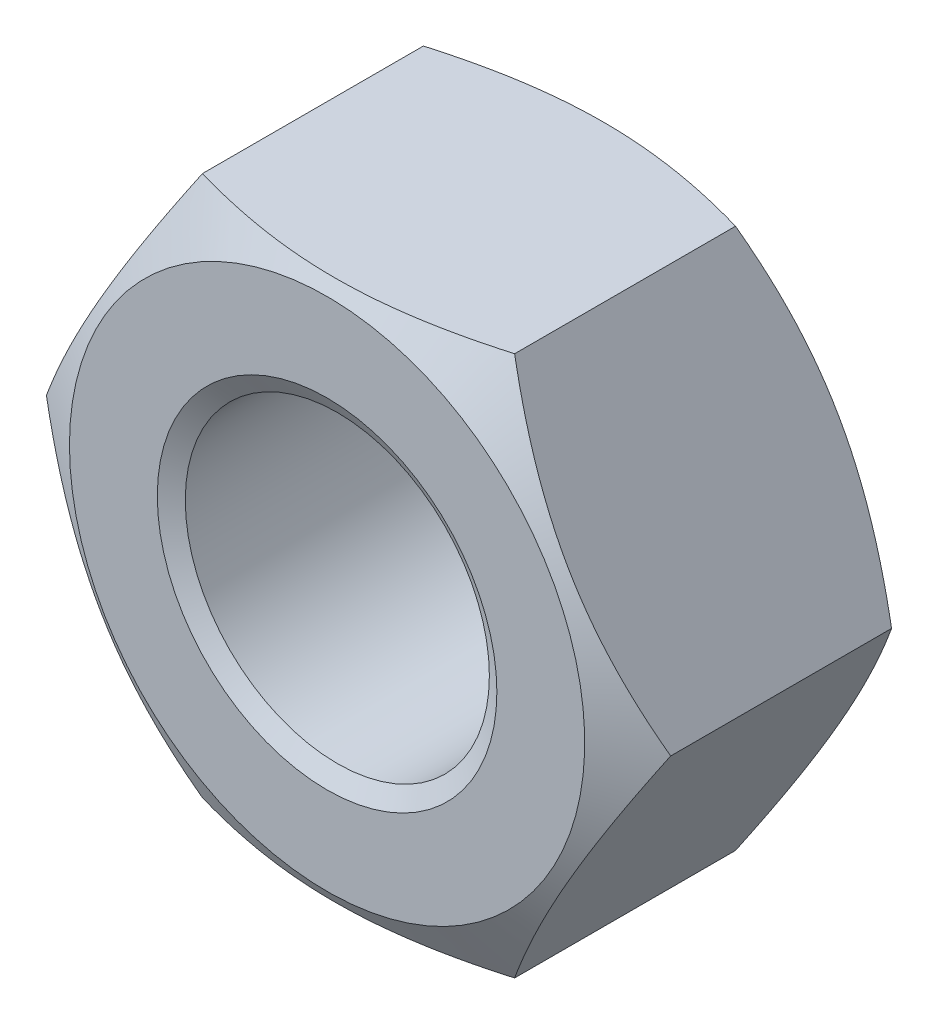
from build123d import *
from OCP.BRepFilletAPI import BRepFilletAPI_MakeChamfer

# Parameters (mm, degrees)
SKETCH1_R        = 4.5
BASENUT_DEPTH    = 8.4
ENDCHAMFER_SIZE  = 0.525
ENDCHAMFER_SIZE2 = 0.303108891


with BuildPart() as part:
    # Sketch1 → BaseNut (new body)
    with BuildSketch(Plane.XY):
        Polygon((4.618802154, -8), (9.237604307, 0), (4.618802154, 8), (-4.618802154, 8), (-9.237604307, 0), (-4.618802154, -8), align=None)
        Circle(SKETCH1_R, mode=Mode.SUBTRACT)
    extrude(amount=-BASENUT_DEPTH)

    # Sketch2 → Double-Chamfer (revolve, cut)
    with BuildSketch(Plane(origin=(0, 0, 0), x_dir=(1, 0, 0), z_dir=(0, 1, 0))):
        Polygon((-9.237604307, 8.4), (-7.625, 8.4), (-9.237604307, 7.468962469), align=None)
        Polygon((-9.237604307, 0.931037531), (-9.237604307, 0), (-7.625, 0), align=None)
    revolve(axis=Axis((0, 0, -9.817107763), (0, 0, 1)), mode=Mode.SUBTRACT)

    # EndChamfer: one chamfer whose edges measure the first distance from different faces: ONE call of the kernel's chamfer builder (chamfer() names one face for all edges)
    endchamfer_edges_1 = [part.edges().sort_by_distance(p)[0] for p in [
        (-4.5, 0, -8.4),
    ]]
    endchamfer_side_1 = [part.faces().sort_by_distance(p)[0] for p in [
        (-4.5, 0, -4.2),
    ]]
    endchamfer_edges_2 = [part.edges().sort_by_distance(p)[0] for p in [
        (-4.5, 0, 0),
    ]]
    endchamfer_side_2 = [part.faces().sort_by_distance(p)[0] for p in [
        (7.409332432, 0, 0),
    ]]
    endchamfer = BRepFilletAPI_MakeChamfer(part.part.solid().wrapped)
    for e in endchamfer_edges_1:
        endchamfer.Add(ENDCHAMFER_SIZE, ENDCHAMFER_SIZE2, e.wrapped, endchamfer_side_1[0].wrapped)  # the first distance lies on this face
    for e in endchamfer_edges_2:
        endchamfer.Add(ENDCHAMFER_SIZE, ENDCHAMFER_SIZE2, e.wrapped, endchamfer_side_2[0].wrapped)  # the first distance lies on this face
    add(Compound.cast(endchamfer.Shape()), mode=Mode.REPLACE)


solid = part.part
